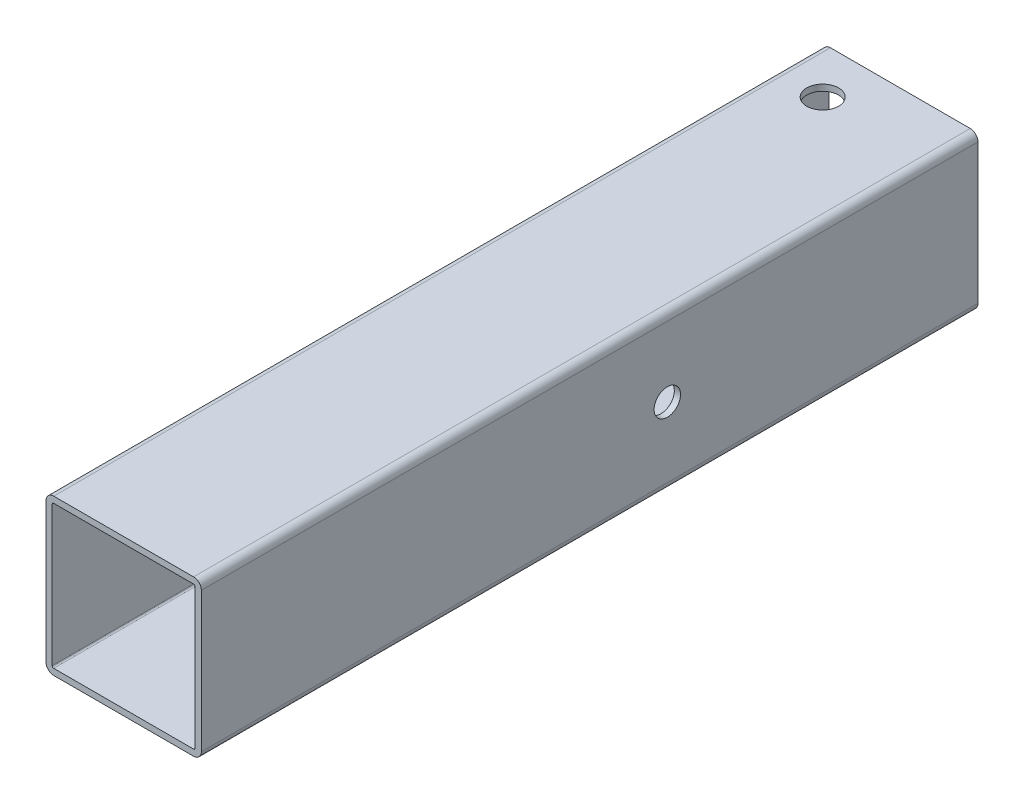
ISO-10303-21;
HEADER;
FILE_DESCRIPTION(('STEP AP214'),'2;1');
FILE_NAME('part.step','',(''),(''),'','','');
FILE_SCHEMA(('AUTOMOTIVE_DESIGN { 1 0 10303 214 1 1 1 1 }'));
ENDSEC;
DATA;
#1=APPLICATION_CONTEXT('core data for automotive mechanical design processes');
#2=APPLICATION_PROTOCOL_DEFINITION('international standard','automotive_design',2000,#1);
#3=PRODUCT_CONTEXT('',#1,'mechanical');
#4=PRODUCT('Part','Part','',(#3));
#5=PRODUCT_RELATED_PRODUCT_CATEGORY('part','',(#4));
#6=PRODUCT_DEFINITION_FORMATION('','',#4);
#7=PRODUCT_DEFINITION_CONTEXT('part definition',#1,'design');
#8=PRODUCT_DEFINITION('design','',#6,#7);
#9=PRODUCT_DEFINITION_SHAPE('','',#8);
#10=(LENGTH_UNIT() NAMED_UNIT(*) SI_UNIT(.MILLI.,.METRE.));
#11=(NAMED_UNIT(*) PLANE_ANGLE_UNIT() SI_UNIT($,.RADIAN.));
#12=(NAMED_UNIT(*) SI_UNIT($,.STERADIAN.) SOLID_ANGLE_UNIT());
#13=UNCERTAINTY_MEASURE_WITH_UNIT(LENGTH_MEASURE(1.E-05),#10,'distance_accuracy_value','');
#14=(GEOMETRIC_REPRESENTATION_CONTEXT(3) GLOBAL_UNCERTAINTY_ASSIGNED_CONTEXT((#13)) GLOBAL_UNIT_ASSIGNED_CONTEXT((#10,
#11,#12)) REPRESENTATION_CONTEXT('',''));
#15=CARTESIAN_POINT('',(0.,0.,0.));
#16=DIRECTION('',(0.,0.,1.));
#17=DIRECTION('',(1.,0.,0.));
#18=AXIS2_PLACEMENT_3D('',#15,#16,#17);
#19=CARTESIAN_POINT('',(95.,-5.,500.));
#20=DIRECTION('',(0.,0.,1.));
#21=DIRECTION('',(1.,0.,0.));
#22=AXIS2_PLACEMENT_3D('',#19,#20,#21);
#23=PLANE('',#22);
#24=CARTESIAN_POINT('',(95.,-5.,500.));
#25=DIRECTION('',(0.,0.,1.));
#26=DIRECTION('',(1.,0.,0.));
#27=AXIS2_PLACEMENT_3D('',#24,#25,#26);
#28=CIRCLE('',#27,5.);
#29=CARTESIAN_POINT('',(100.,-5.00000000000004,500.));
#30=VERTEX_POINT('',#29);
#31=CARTESIAN_POINT('',(95.,0.,500.));
#32=VERTEX_POINT('',#31);
#33=EDGE_CURVE('E231',#30,#32,#28,.T.);
#34=ORIENTED_EDGE('',*,*,#33,.T.);
#35=DIRECTION('',(-1.,0.,0.));
#36=VECTOR('',#35,1.);
#37=CARTESIAN_POINT('',(5.00000000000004,0.,500.));
#38=LINE('',#37,#36);
#39=CARTESIAN_POINT('',(5.00000000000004,0.,500.));
#40=VERTEX_POINT('',#39);
#41=EDGE_CURVE('E234',#32,#40,#38,.T.);
#42=ORIENTED_EDGE('',*,*,#41,.T.);
#43=CARTESIAN_POINT('',(5.,-5.,500.));
#44=DIRECTION('',(0.,0.,1.));
#45=DIRECTION('',(1.,0.,0.));
#46=AXIS2_PLACEMENT_3D('',#43,#44,#45);
#47=CIRCLE('',#46,5.);
#48=CARTESIAN_POINT('',(0.,-5.00000000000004,500.));
#49=VERTEX_POINT('',#48);
#50=EDGE_CURVE('E236',#40,#49,#47,.T.);
#51=ORIENTED_EDGE('',*,*,#50,.T.);
#52=DIRECTION('',(0.,-1.,0.));
#53=VECTOR('',#52,1.);
#54=CARTESIAN_POINT('',(0.,-5.00000000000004,500.));
#55=LINE('',#54,#53);
#56=CARTESIAN_POINT('',(0.,-95.,500.));
#57=VERTEX_POINT('',#56);
#58=EDGE_CURVE('E238',#49,#57,#55,.T.);
#59=ORIENTED_EDGE('',*,*,#58,.T.);
#60=CARTESIAN_POINT('',(5.00000000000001,-95.,500.));
#61=DIRECTION('',(0.,0.,1.));
#62=DIRECTION('',(-1.,0.,0.));
#63=AXIS2_PLACEMENT_3D('',#60,#61,#62);
#64=CIRCLE('',#63,5.);
#65=CARTESIAN_POINT('',(5.00000000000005,-100.,500.));
#66=VERTEX_POINT('',#65);
#67=EDGE_CURVE('E240',#57,#66,#64,.T.);
#68=ORIENTED_EDGE('',*,*,#67,.T.);
#69=DIRECTION('',(1.,0.,0.));
#70=VECTOR('',#69,1.);
#71=CARTESIAN_POINT('',(5.00000000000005,-100.,500.));
#72=LINE('',#71,#70);
#73=CARTESIAN_POINT('',(95.,-100.,500.));
#74=VERTEX_POINT('',#73);
#75=EDGE_CURVE('E242',#66,#74,#72,.T.);
#76=ORIENTED_EDGE('',*,*,#75,.T.);
#77=CARTESIAN_POINT('',(95.,-95.,500.));
#78=DIRECTION('',(0.,0.,1.));
#79=DIRECTION('',(1.,0.,0.));
#80=AXIS2_PLACEMENT_3D('',#77,#78,#79);
#81=CIRCLE('',#80,5.);
#82=CARTESIAN_POINT('',(100.,-95.,500.));
#83=VERTEX_POINT('',#82);
#84=EDGE_CURVE('E244',#74,#83,#81,.T.);
#85=ORIENTED_EDGE('',*,*,#84,.T.);
#86=DIRECTION('',(0.,1.,0.));
#87=VECTOR('',#86,1.);
#88=CARTESIAN_POINT('',(100.,-5.00000000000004,500.));
#89=LINE('',#88,#87);
#90=EDGE_CURVE('E246',#83,#30,#89,.T.);
#91=ORIENTED_EDGE('',*,*,#90,.T.);
#92=EDGE_LOOP('',(#34,#42,#51,#59,#68,#76,#85,#91));
#93=FACE_BOUND('',#92,.T.);
#94=DIRECTION('',(0.,-1.,0.));
#95=VECTOR('',#94,1.);
#96=CARTESIAN_POINT('',(4.,-5.00000000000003,500.));
#97=LINE('',#96,#95);
#98=CARTESIAN_POINT('',(4.,-5.00000000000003,500.));
#99=VERTEX_POINT('',#98);
#100=CARTESIAN_POINT('',(4.00000000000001,-95.,500.));
#101=VERTEX_POINT('',#100);
#102=EDGE_CURVE('E189',#99,#101,#97,.T.);
#103=ORIENTED_EDGE('',*,*,#102,.F.);
#104=CARTESIAN_POINT('',(5.,-5.,500.));
#105=DIRECTION('',(0.,0.,1.));
#106=DIRECTION('',(1.,0.,0.));
#107=AXIS2_PLACEMENT_3D('',#104,#105,#106);
#108=CIRCLE('',#107,0.999999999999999);
#109=CARTESIAN_POINT('',(5.00000000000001,-4.,500.));
#110=VERTEX_POINT('',#109);
#111=EDGE_CURVE('E161',#110,#99,#108,.T.);
#112=ORIENTED_EDGE('',*,*,#111,.F.);
#113=DIRECTION('',(-1.,0.,0.));
#114=VECTOR('',#113,1.);
#115=CARTESIAN_POINT('',(5.00000000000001,-4.,500.));
#116=LINE('',#115,#114);
#117=CARTESIAN_POINT('',(95.,-4.,500.));
#118=VERTEX_POINT('',#117);
#119=EDGE_CURVE('E201',#118,#110,#116,.T.);
#120=ORIENTED_EDGE('',*,*,#119,.F.);
#121=CARTESIAN_POINT('',(95.,-5.,500.));
#122=DIRECTION('',(0.,0.,1.));
#123=DIRECTION('',(1.,0.,0.));
#124=AXIS2_PLACEMENT_3D('',#121,#122,#123);
#125=CIRCLE('',#124,1.);
#126=CARTESIAN_POINT('',(96.,-5.00000000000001,500.));
#127=VERTEX_POINT('',#126);
#128=EDGE_CURVE('E199',#127,#118,#125,.T.);
#129=ORIENTED_EDGE('',*,*,#128,.F.);
#130=DIRECTION('',(0.,1.,0.));
#131=VECTOR('',#130,1.);
#132=CARTESIAN_POINT('',(96.,-5.00000000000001,500.));
#133=LINE('',#132,#131);
#134=CARTESIAN_POINT('',(96.,-95.,500.));
#135=VERTEX_POINT('',#134);
#136=EDGE_CURVE('E197',#135,#127,#133,.T.);
#137=ORIENTED_EDGE('',*,*,#136,.F.);
#138=CARTESIAN_POINT('',(95.,-95.,500.));
#139=DIRECTION('',(0.,0.,1.));
#140=DIRECTION('',(1.,0.,0.));
#141=AXIS2_PLACEMENT_3D('',#138,#139,#140);
#142=CIRCLE('',#141,1.);
#143=CARTESIAN_POINT('',(95.,-96.,500.));
#144=VERTEX_POINT('',#143);
#145=EDGE_CURVE('E195',#144,#135,#142,.T.);
#146=ORIENTED_EDGE('',*,*,#145,.F.);
#147=DIRECTION('',(1.,0.,0.));
#148=VECTOR('',#147,1.);
#149=CARTESIAN_POINT('',(5.00000000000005,-96.,500.));
#150=LINE('',#149,#148);
#151=CARTESIAN_POINT('',(5.00000000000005,-96.,500.));
#152=VERTEX_POINT('',#151);
#153=EDGE_CURVE('E193',#152,#144,#150,.T.);
#154=ORIENTED_EDGE('',*,*,#153,.F.);
#155=CARTESIAN_POINT('',(5.00000000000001,-95.,500.));
#156=DIRECTION('',(0.,0.,1.));
#157=DIRECTION('',(-1.,0.,0.));
#158=AXIS2_PLACEMENT_3D('',#155,#156,#157);
#159=CIRCLE('',#158,1.);
#160=EDGE_CURVE('E191',#101,#152,#159,.T.);
#161=ORIENTED_EDGE('',*,*,#160,.F.);
#162=EDGE_LOOP('',(#103,#112,#120,#129,#137,#146,#154,#161));
#163=FACE_BOUND('',#162,.T.);
#164=ADVANCED_FACE('F31',(#93,#163),#23,.T.);
#165=CARTESIAN_POINT('',(95.,-5.,0.));
#166=DIRECTION('',(0.,0.,1.));
#167=DIRECTION('',(1.,0.,0.));
#168=AXIS2_PLACEMENT_3D('',#165,#166,#167);
#169=PLANE('',#168);
#170=CARTESIAN_POINT('',(95.,-5.,0.));
#171=DIRECTION('',(0.,0.,1.));
#172=DIRECTION('',(1.,0.,0.));
#173=AXIS2_PLACEMENT_3D('',#170,#171,#172);
#174=CIRCLE('',#173,5.);
#175=CARTESIAN_POINT('',(100.,-5.00000000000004,0.));
#176=VERTEX_POINT('',#175);
#177=CARTESIAN_POINT('',(95.,0.,0.));
#178=VERTEX_POINT('',#177);
#179=EDGE_CURVE('E162',#176,#178,#174,.T.);
#180=ORIENTED_EDGE('',*,*,#179,.F.);
#181=DIRECTION('',(0.,1.,0.));
#182=VECTOR('',#181,1.);
#183=CARTESIAN_POINT('',(100.,-5.00000000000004,0.));
#184=LINE('',#183,#182);
#185=CARTESIAN_POINT('',(100.,-95.,0.));
#186=VERTEX_POINT('',#185);
#187=EDGE_CURVE('E229',#186,#176,#184,.T.);
#188=ORIENTED_EDGE('',*,*,#187,.F.);
#189=CARTESIAN_POINT('',(95.,-95.,0.));
#190=DIRECTION('',(0.,0.,1.));
#191=DIRECTION('',(1.,0.,0.));
#192=AXIS2_PLACEMENT_3D('',#189,#190,#191);
#193=CIRCLE('',#192,5.);
#194=CARTESIAN_POINT('',(95.,-100.,0.));
#195=VERTEX_POINT('',#194);
#196=EDGE_CURVE('E227',#195,#186,#193,.T.);
#197=ORIENTED_EDGE('',*,*,#196,.F.);
#198=DIRECTION('',(1.,0.,0.));
#199=VECTOR('',#198,1.);
#200=CARTESIAN_POINT('',(5.00000000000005,-100.,0.));
#201=LINE('',#200,#199);
#202=CARTESIAN_POINT('',(5.00000000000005,-100.,0.));
#203=VERTEX_POINT('',#202);
#204=EDGE_CURVE('E225',#203,#195,#201,.T.);
#205=ORIENTED_EDGE('',*,*,#204,.F.);
#206=CARTESIAN_POINT('',(5.00000000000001,-95.,0.));
#207=DIRECTION('',(0.,0.,1.));
#208=DIRECTION('',(-1.,0.,0.));
#209=AXIS2_PLACEMENT_3D('',#206,#207,#208);
#210=CIRCLE('',#209,5.);
#211=CARTESIAN_POINT('',(0.,-95.,0.));
#212=VERTEX_POINT('',#211);
#213=EDGE_CURVE('E223',#212,#203,#210,.T.);
#214=ORIENTED_EDGE('',*,*,#213,.F.);
#215=DIRECTION('',(0.,-1.,0.));
#216=VECTOR('',#215,1.);
#217=CARTESIAN_POINT('',(0.,-5.00000000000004,0.));
#218=LINE('',#217,#216);
#219=CARTESIAN_POINT('',(0.,-5.00000000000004,0.));
#220=VERTEX_POINT('',#219);
#221=EDGE_CURVE('E221',#220,#212,#218,.T.);
#222=ORIENTED_EDGE('',*,*,#221,.F.);
#223=CARTESIAN_POINT('',(5.,-5.,0.));
#224=DIRECTION('',(0.,0.,1.));
#225=DIRECTION('',(1.,0.,0.));
#226=AXIS2_PLACEMENT_3D('',#223,#224,#225);
#227=CIRCLE('',#226,5.);
#228=CARTESIAN_POINT('',(5.00000000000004,0.,0.));
#229=VERTEX_POINT('',#228);
#230=EDGE_CURVE('E219',#229,#220,#227,.T.);
#231=ORIENTED_EDGE('',*,*,#230,.F.);
#232=DIRECTION('',(-1.,0.,0.));
#233=VECTOR('',#232,1.);
#234=CARTESIAN_POINT('',(5.00000000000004,0.,0.));
#235=LINE('',#234,#233);
#236=EDGE_CURVE('E217',#178,#229,#235,.T.);
#237=ORIENTED_EDGE('',*,*,#236,.F.);
#238=EDGE_LOOP('',(#180,#188,#197,#205,#214,#222,#231,#237));
#239=FACE_BOUND('',#238,.T.);
#240=CARTESIAN_POINT('',(5.,-5.,0.));
#241=DIRECTION('',(0.,0.,1.));
#242=DIRECTION('',(1.,0.,0.));
#243=AXIS2_PLACEMENT_3D('',#240,#241,#242);
#244=CIRCLE('',#243,0.999999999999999);
#245=CARTESIAN_POINT('',(5.,-4.,0.));
#246=VERTEX_POINT('',#245);
#247=CARTESIAN_POINT('',(4.,-5.00000000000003,0.));
#248=VERTEX_POINT('',#247);
#249=EDGE_CURVE('E56',#246,#248,#244,.T.);
#250=ORIENTED_EDGE('',*,*,#249,.T.);
#251=DIRECTION('',(0.,-1.,0.));
#252=VECTOR('',#251,1.);
#253=CARTESIAN_POINT('',(4.,-5.00000000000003,0.));
#254=LINE('',#253,#252);
#255=CARTESIAN_POINT('',(4.00000000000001,-95.,0.));
#256=VERTEX_POINT('',#255);
#257=EDGE_CURVE('E148',#248,#256,#254,.T.);
#258=ORIENTED_EDGE('',*,*,#257,.T.);
#259=CARTESIAN_POINT('',(5.00000000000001,-95.,0.));
#260=DIRECTION('',(0.,0.,1.));
#261=DIRECTION('',(-1.,0.,0.));
#262=AXIS2_PLACEMENT_3D('',#259,#260,#261);
#263=CIRCLE('',#262,1.);
#264=CARTESIAN_POINT('',(5.00000000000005,-96.,0.));
#265=VERTEX_POINT('',#264);
#266=EDGE_CURVE('E157',#256,#265,#263,.T.);
#267=ORIENTED_EDGE('',*,*,#266,.T.);
#268=DIRECTION('',(1.,0.,0.));
#269=VECTOR('',#268,1.);
#270=CARTESIAN_POINT('',(5.00000000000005,-96.,0.));
#271=LINE('',#270,#269);
#272=CARTESIAN_POINT('',(95.,-96.,0.));
#273=VERTEX_POINT('',#272);
#274=EDGE_CURVE('E176',#265,#273,#271,.T.);
#275=ORIENTED_EDGE('',*,*,#274,.T.);
#276=CARTESIAN_POINT('',(95.,-95.,0.));
#277=DIRECTION('',(0.,0.,1.));
#278=DIRECTION('',(1.,0.,0.));
#279=AXIS2_PLACEMENT_3D('',#276,#277,#278);
#280=CIRCLE('',#279,1.);
#281=CARTESIAN_POINT('',(96.,-95.,0.));
#282=VERTEX_POINT('',#281);
#283=EDGE_CURVE('E179',#273,#282,#280,.T.);
#284=ORIENTED_EDGE('',*,*,#283,.T.);
#285=DIRECTION('',(0.,1.,0.));
#286=VECTOR('',#285,1.);
#287=CARTESIAN_POINT('',(96.,-5.00000000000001,0.));
#288=LINE('',#287,#286);
#289=CARTESIAN_POINT('',(96.,-5.00000000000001,0.));
#290=VERTEX_POINT('',#289);
#291=EDGE_CURVE('E182',#282,#290,#288,.T.);
#292=ORIENTED_EDGE('',*,*,#291,.T.);
#293=CARTESIAN_POINT('',(95.,-5.,0.));
#294=DIRECTION('',(0.,0.,1.));
#295=DIRECTION('',(1.,0.,0.));
#296=AXIS2_PLACEMENT_3D('',#293,#294,#295);
#297=CIRCLE('',#296,1.);
#298=CARTESIAN_POINT('',(95.,-4.,0.));
#299=VERTEX_POINT('',#298);
#300=EDGE_CURVE('E185',#290,#299,#297,.T.);
#301=ORIENTED_EDGE('',*,*,#300,.T.);
#302=DIRECTION('',(-1.,0.,0.));
#303=VECTOR('',#302,1.);
#304=CARTESIAN_POINT('',(5.00000000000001,-4.,0.));
#305=LINE('',#304,#303);
#306=EDGE_CURVE('E167',#299,#246,#305,.T.);
#307=ORIENTED_EDGE('',*,*,#306,.T.);
#308=EDGE_LOOP('',(#250,#258,#267,#275,#284,#292,#301,#307));
#309=FACE_BOUND('',#308,.T.);
#310=ADVANCED_FACE('F165',(#239,#309),#169,.F.);
#311=CARTESIAN_POINT('',(95.,-5.,500.));
#312=DIRECTION('',(0.,0.,-1.));
#313=DIRECTION('',(-1.,0.,0.));
#314=AXIS2_PLACEMENT_3D('',#311,#312,#313);
#315=CYLINDRICAL_SURFACE('',#314,5.);
#316=ORIENTED_EDGE('',*,*,#179,.T.);
#317=DIRECTION('',(0.,0.,-1.));
#318=VECTOR('',#317,1.);
#319=CARTESIAN_POINT('',(95.,0.,500.));
#320=LINE('',#319,#318);
#321=EDGE_CURVE('E11',#32,#178,#320,.T.);
#322=ORIENTED_EDGE('',*,*,#321,.F.);
#323=ORIENTED_EDGE('',*,*,#33,.F.);
#324=DIRECTION('',(0.,0.,-1.));
#325=VECTOR('',#324,1.);
#326=CARTESIAN_POINT('',(100.,-5.00000000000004,500.));
#327=LINE('',#326,#325);
#328=EDGE_CURVE('E248',#30,#176,#327,.T.);
#329=ORIENTED_EDGE('',*,*,#328,.T.);
#330=EDGE_LOOP('',(#316,#322,#323,#329));
#331=FACE_BOUND('',#330,.T.);
#332=ADVANCED_FACE('F33',(#331),#315,.T.);
#333=CARTESIAN_POINT('',(5.00000000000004,0.,500.));
#334=DIRECTION('',(0.,-1.,0.));
#335=DIRECTION('',(0.,0.,-1.));
#336=AXIS2_PLACEMENT_3D('',#333,#334,#335);
#337=PLANE('',#336);
#338=CARTESIAN_POINT('',(30.,0.,30.));
#339=DIRECTION('',(0.,1.,0.));
#340=DIRECTION('',(0.,0.,1.));
#341=AXIS2_PLACEMENT_3D('',#338,#339,#340);
#342=CIRCLE('',#341,10.25);
#343=CARTESIAN_POINT('',(30.,0.,40.25));
#344=VERTEX_POINT('',#343);
#345=EDGE_CURVE('E350',#344,#344,#342,.T.);
#346=ORIENTED_EDGE('',*,*,#345,.F.);
#347=EDGE_LOOP('',(#346));
#348=FACE_BOUND('',#347,.T.);
#349=ORIENTED_EDGE('',*,*,#236,.T.);
#350=DIRECTION('',(0.,0.,-1.));
#351=VECTOR('',#350,1.);
#352=CARTESIAN_POINT('',(5.00000000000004,0.,500.));
#353=LINE('',#352,#351);
#354=EDGE_CURVE('E40',#40,#229,#353,.T.);
#355=ORIENTED_EDGE('',*,*,#354,.F.);
#356=ORIENTED_EDGE('',*,*,#41,.F.);
#357=ORIENTED_EDGE('',*,*,#321,.T.);
#358=EDGE_LOOP('',(#349,#355,#356,#357));
#359=FACE_BOUND('',#358,.T.);
#360=ADVANCED_FACE('F339',(#348,#359),#337,.F.);
#361=CARTESIAN_POINT('',(5.,-5.,500.));
#362=DIRECTION('',(0.,0.,-1.));
#363=DIRECTION('',(-1.,0.,0.));
#364=AXIS2_PLACEMENT_3D('',#361,#362,#363);
#365=CYLINDRICAL_SURFACE('',#364,5.);
#366=ORIENTED_EDGE('',*,*,#230,.T.);
#367=DIRECTION('',(0.,0.,-1.));
#368=VECTOR('',#367,1.);
#369=CARTESIAN_POINT('',(0.,-5.00000000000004,500.));
#370=LINE('',#369,#368);
#371=EDGE_CURVE('E263',#49,#220,#370,.T.);
#372=ORIENTED_EDGE('',*,*,#371,.F.);
#373=ORIENTED_EDGE('',*,*,#50,.F.);
#374=ORIENTED_EDGE('',*,*,#354,.T.);
#375=EDGE_LOOP('',(#366,#372,#373,#374));
#376=FACE_BOUND('',#375,.T.);
#377=ADVANCED_FACE('F336',(#376),#365,.T.);
#378=CARTESIAN_POINT('',(0.,-5.00000000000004,500.));
#379=DIRECTION('',(1.,0.,0.));
#380=DIRECTION('',(0.,1.,0.));
#381=AXIS2_PLACEMENT_3D('',#378,#379,#380);
#382=PLANE('',#381);
#383=CARTESIAN_POINT('',(0.,-85.,30.));
#384=DIRECTION('',(-1.,0.,0.));
#385=DIRECTION('',(0.,-1.,0.));
#386=AXIS2_PLACEMENT_3D('',#383,#384,#385);
#387=CIRCLE('',#386,3.25);
#388=CARTESIAN_POINT('',(0.,-88.25,30.));
#389=VERTEX_POINT('',#388);
#390=EDGE_CURVE('E273',#389,#389,#387,.T.);
#391=ORIENTED_EDGE('',*,*,#390,.F.);
#392=EDGE_LOOP('',(#391));
#393=FACE_BOUND('',#392,.T.);
#394=CARTESIAN_POINT('',(0.,-50.,200.));
#395=DIRECTION('',(-1.,0.,0.));
#396=DIRECTION('',(0.,-1.,0.));
#397=AXIS2_PLACEMENT_3D('',#394,#395,#396);
#398=CIRCLE('',#397,8.49999999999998);
#399=CARTESIAN_POINT('',(0.,-58.5,200.));
#400=VERTEX_POINT('',#399);
#401=EDGE_CURVE('E272',#400,#400,#398,.T.);
#402=ORIENTED_EDGE('',*,*,#401,.F.);
#403=EDGE_LOOP('',(#402));
#404=FACE_BOUND('',#403,.T.);
#405=ORIENTED_EDGE('',*,*,#221,.T.);
#406=DIRECTION('',(0.,0.,-1.));
#407=VECTOR('',#406,1.);
#408=CARTESIAN_POINT('',(0.,-95.,500.));
#409=LINE('',#408,#407);
#410=EDGE_CURVE('E260',#57,#212,#409,.T.);
#411=ORIENTED_EDGE('',*,*,#410,.F.);
#412=ORIENTED_EDGE('',*,*,#58,.F.);
#413=ORIENTED_EDGE('',*,*,#371,.T.);
#414=EDGE_LOOP('',(#405,#411,#412,#413));
#415=FACE_BOUND('',#414,.T.);
#416=ADVANCED_FACE('F332',(#393,#404,#415),#382,.F.);
#417=CARTESIAN_POINT('',(5.00000000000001,-95.,500.));
#418=DIRECTION('',(0.,0.,-1.));
#419=DIRECTION('',(-1.,0.,0.));
#420=AXIS2_PLACEMENT_3D('',#417,#418,#419);
#421=CYLINDRICAL_SURFACE('',#420,5.);
#422=ORIENTED_EDGE('',*,*,#213,.T.);
#423=DIRECTION('',(0.,0.,-1.));
#424=VECTOR('',#423,1.);
#425=CARTESIAN_POINT('',(5.00000000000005,-100.,500.));
#426=LINE('',#425,#424);
#427=EDGE_CURVE('E257',#66,#203,#426,.T.);
#428=ORIENTED_EDGE('',*,*,#427,.F.);
#429=ORIENTED_EDGE('',*,*,#67,.F.);
#430=ORIENTED_EDGE('',*,*,#410,.T.);
#431=EDGE_LOOP('',(#422,#428,#429,#430));
#432=FACE_BOUND('',#431,.T.);
#433=ADVANCED_FACE('F328',(#432),#421,.T.);
#434=CARTESIAN_POINT('',(5.00000000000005,-100.,500.));
#435=DIRECTION('',(0.,1.,0.));
#436=DIRECTION('',(0.,0.,1.));
#437=AXIS2_PLACEMENT_3D('',#434,#435,#436);
#438=PLANE('',#437);
#439=CARTESIAN_POINT('',(30.,-100.,30.));
#440=DIRECTION('',(0.,1.,0.));
#441=DIRECTION('',(0.,0.,1.));
#442=AXIS2_PLACEMENT_3D('',#439,#440,#441);
#443=CIRCLE('',#442,10.25);
#444=CARTESIAN_POINT('',(30.,-100.,40.25));
#445=VERTEX_POINT('',#444);
#446=EDGE_CURVE('E376',#445,#445,#443,.T.);
#447=ORIENTED_EDGE('',*,*,#446,.T.);
#448=EDGE_LOOP('',(#447));
#449=FACE_BOUND('',#448,.T.);
#450=ORIENTED_EDGE('',*,*,#204,.T.);
#451=DIRECTION('',(0.,0.,-1.));
#452=VECTOR('',#451,1.);
#453=CARTESIAN_POINT('',(95.,-100.,500.));
#454=LINE('',#453,#452);
#455=EDGE_CURVE('E254',#74,#195,#454,.T.);
#456=ORIENTED_EDGE('',*,*,#455,.F.);
#457=ORIENTED_EDGE('',*,*,#75,.F.);
#458=ORIENTED_EDGE('',*,*,#427,.T.);
#459=EDGE_LOOP('',(#450,#456,#457,#458));
#460=FACE_BOUND('',#459,.T.);
#461=ADVANCED_FACE('F324',(#449,#460),#438,.F.);
#462=CARTESIAN_POINT('',(95.,-95.,500.));
#463=DIRECTION('',(0.,0.,-1.));
#464=DIRECTION('',(-1.,0.,0.));
#465=AXIS2_PLACEMENT_3D('',#462,#463,#464);
#466=CYLINDRICAL_SURFACE('',#465,5.);
#467=ORIENTED_EDGE('',*,*,#196,.T.);
#468=DIRECTION('',(0.,0.,-1.));
#469=VECTOR('',#468,1.);
#470=CARTESIAN_POINT('',(100.,-95.,500.));
#471=LINE('',#470,#469);
#472=EDGE_CURVE('E251',#83,#186,#471,.T.);
#473=ORIENTED_EDGE('',*,*,#472,.F.);
#474=ORIENTED_EDGE('',*,*,#84,.F.);
#475=ORIENTED_EDGE('',*,*,#455,.T.);
#476=EDGE_LOOP('',(#467,#473,#474,#475));
#477=FACE_BOUND('',#476,.T.);
#478=ADVANCED_FACE('F321',(#477),#466,.T.);
#479=CARTESIAN_POINT('',(100.,-5.00000000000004,500.));
#480=DIRECTION('',(-1.,0.,0.));
#481=DIRECTION('',(0.,0.,1.));
#482=AXIS2_PLACEMENT_3D('',#479,#480,#481);
#483=PLANE('',#482);
#484=CARTESIAN_POINT('',(100.,-50.,200.));
#485=DIRECTION('',(-1.,0.,0.));
#486=DIRECTION('',(0.,-1.,0.));
#487=AXIS2_PLACEMENT_3D('',#484,#485,#486);
#488=CIRCLE('',#487,8.49999999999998);
#489=CARTESIAN_POINT('',(100.,-58.5,200.));
#490=VERTEX_POINT('',#489);
#491=EDGE_CURVE('E269',#490,#490,#488,.T.);
#492=ORIENTED_EDGE('',*,*,#491,.T.);
#493=EDGE_LOOP('',(#492));
#494=FACE_BOUND('',#493,.T.);
#495=ORIENTED_EDGE('',*,*,#187,.T.);
#496=ORIENTED_EDGE('',*,*,#328,.F.);
#497=ORIENTED_EDGE('',*,*,#90,.F.);
#498=ORIENTED_EDGE('',*,*,#472,.T.);
#499=EDGE_LOOP('',(#495,#496,#497,#498));
#500=FACE_BOUND('',#499,.T.);
#501=ADVANCED_FACE('F289',(#494,#500),#483,.F.);
#502=CARTESIAN_POINT('',(5.,-5.,500.));
#503=DIRECTION('',(0.,0.,-1.));
#504=DIRECTION('',(-1.,0.,0.));
#505=AXIS2_PLACEMENT_3D('',#502,#503,#504);
#506=CYLINDRICAL_SURFACE('',#505,0.999999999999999);
#507=ORIENTED_EDGE('',*,*,#249,.F.);
#508=DIRECTION('',(0.,0.,-1.));
#509=VECTOR('',#508,1.);
#510=CARTESIAN_POINT('',(5.00000000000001,-4.,500.));
#511=LINE('',#510,#509);
#512=EDGE_CURVE('E203',#110,#246,#511,.T.);
#513=ORIENTED_EDGE('',*,*,#512,.F.);
#514=ORIENTED_EDGE('',*,*,#111,.T.);
#515=DIRECTION('',(0.,0.,-1.));
#516=VECTOR('',#515,1.);
#517=CARTESIAN_POINT('',(4.,-5.00000000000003,500.));
#518=LINE('',#517,#516);
#519=EDGE_CURVE('E150',#99,#248,#518,.T.);
#520=ORIENTED_EDGE('',*,*,#519,.T.);
#521=EDGE_LOOP('',(#507,#513,#514,#520));
#522=FACE_BOUND('',#521,.T.);
#523=ADVANCED_FACE('F159',(#522),#506,.F.);
#524=CARTESIAN_POINT('',(4.,-5.00000000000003,500.));
#525=DIRECTION('',(1.,0.,0.));
#526=DIRECTION('',(0.,1.,0.));
#527=AXIS2_PLACEMENT_3D('',#524,#525,#526);
#528=PLANE('',#527);
#529=CARTESIAN_POINT('',(4.00000000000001,-85.,30.));
#530=DIRECTION('',(1.,0.,0.));
#531=DIRECTION('',(0.,1.,0.));
#532=AXIS2_PLACEMENT_3D('',#529,#530,#531);
#533=CIRCLE('',#532,3.25);
#534=CARTESIAN_POINT('',(4.00000000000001,-81.75,30.));
#535=VERTEX_POINT('',#534);
#536=EDGE_CURVE('E270',#535,#535,#533,.T.);
#537=ORIENTED_EDGE('',*,*,#536,.F.);
#538=EDGE_LOOP('',(#537));
#539=FACE_BOUND('',#538,.T.);
#540=CARTESIAN_POINT('',(4.,-50.,200.));
#541=DIRECTION('',(1.,0.,0.));
#542=DIRECTION('',(0.,1.,0.));
#543=AXIS2_PLACEMENT_3D('',#540,#541,#542);
#544=CIRCLE('',#543,8.49999999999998);
#545=CARTESIAN_POINT('',(4.,-41.5,200.));
#546=VERTEX_POINT('',#545);
#547=EDGE_CURVE('E168',#546,#546,#544,.T.);
#548=ORIENTED_EDGE('',*,*,#547,.F.);
#549=EDGE_LOOP('',(#548));
#550=FACE_BOUND('',#549,.T.);
#551=ORIENTED_EDGE('',*,*,#257,.F.);
#552=ORIENTED_EDGE('',*,*,#519,.F.);
#553=ORIENTED_EDGE('',*,*,#102,.T.);
#554=DIRECTION('',(0.,0.,-1.));
#555=VECTOR('',#554,1.);
#556=CARTESIAN_POINT('',(4.00000000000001,-95.,500.));
#557=LINE('',#556,#555);
#558=EDGE_CURVE('E153',#101,#256,#557,.T.);
#559=ORIENTED_EDGE('',*,*,#558,.T.);
#560=EDGE_LOOP('',(#551,#552,#553,#559));
#561=FACE_BOUND('',#560,.T.);
#562=ADVANCED_FACE('F149',(#539,#550,#561),#528,.T.);
#563=CARTESIAN_POINT('',(5.00000000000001,-95.,500.));
#564=DIRECTION('',(0.,0.,-1.));
#565=DIRECTION('',(-1.,0.,0.));
#566=AXIS2_PLACEMENT_3D('',#563,#564,#565);
#567=CYLINDRICAL_SURFACE('',#566,1.);
#568=ORIENTED_EDGE('',*,*,#266,.F.);
#569=ORIENTED_EDGE('',*,*,#558,.F.);
#570=ORIENTED_EDGE('',*,*,#160,.T.);
#571=DIRECTION('',(0.,0.,-1.));
#572=VECTOR('',#571,1.);
#573=CARTESIAN_POINT('',(5.00000000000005,-96.,500.));
#574=LINE('',#573,#572);
#575=EDGE_CURVE('E212',#152,#265,#574,.T.);
#576=ORIENTED_EDGE('',*,*,#575,.T.);
#577=EDGE_LOOP('',(#568,#569,#570,#576));
#578=FACE_BOUND('',#577,.T.);
#579=ADVANCED_FACE('F394',(#578),#567,.F.);
#580=CARTESIAN_POINT('',(5.00000000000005,-96.,500.));
#581=DIRECTION('',(0.,1.,0.));
#582=DIRECTION('',(0.,0.,1.));
#583=AXIS2_PLACEMENT_3D('',#580,#581,#582);
#584=PLANE('',#583);
#585=CARTESIAN_POINT('',(30.,-96.,30.));
#586=DIRECTION('',(0.,1.,0.));
#587=DIRECTION('',(0.,0.,1.));
#588=AXIS2_PLACEMENT_3D('',#585,#586,#587);
#589=CIRCLE('',#588,10.25);
#590=CARTESIAN_POINT('',(30.,-96.,40.25));
#591=VERTEX_POINT('',#590);
#592=EDGE_CURVE('E279',#591,#591,#589,.T.);
#593=ORIENTED_EDGE('',*,*,#592,.F.);
#594=EDGE_LOOP('',(#593));
#595=FACE_BOUND('',#594,.T.);
#596=ORIENTED_EDGE('',*,*,#274,.F.);
#597=ORIENTED_EDGE('',*,*,#575,.F.);
#598=ORIENTED_EDGE('',*,*,#153,.T.);
#599=DIRECTION('',(0.,0.,-1.));
#600=VECTOR('',#599,1.);
#601=CARTESIAN_POINT('',(95.,-96.,500.));
#602=LINE('',#601,#600);
#603=EDGE_CURVE('E210',#144,#273,#602,.T.);
#604=ORIENTED_EDGE('',*,*,#603,.T.);
#605=EDGE_LOOP('',(#596,#597,#598,#604));
#606=FACE_BOUND('',#605,.T.);
#607=ADVANCED_FACE('F399',(#595,#606),#584,.T.);
#608=CARTESIAN_POINT('',(95.,-95.,500.));
#609=DIRECTION('',(0.,0.,-1.));
#610=DIRECTION('',(-1.,0.,0.));
#611=AXIS2_PLACEMENT_3D('',#608,#609,#610);
#612=CYLINDRICAL_SURFACE('',#611,1.);
#613=ORIENTED_EDGE('',*,*,#283,.F.);
#614=ORIENTED_EDGE('',*,*,#603,.F.);
#615=ORIENTED_EDGE('',*,*,#145,.T.);
#616=DIRECTION('',(0.,0.,-1.));
#617=VECTOR('',#616,1.);
#618=CARTESIAN_POINT('',(96.,-95.,500.));
#619=LINE('',#618,#617);
#620=EDGE_CURVE('E208',#135,#282,#619,.T.);
#621=ORIENTED_EDGE('',*,*,#620,.T.);
#622=EDGE_LOOP('',(#613,#614,#615,#621));
#623=FACE_BOUND('',#622,.T.);
#624=ADVANCED_FACE('F403',(#623),#612,.F.);
#625=CARTESIAN_POINT('',(96.,-5.00000000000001,500.));
#626=DIRECTION('',(-1.,0.,0.));
#627=DIRECTION('',(0.,0.,1.));
#628=AXIS2_PLACEMENT_3D('',#625,#626,#627);
#629=PLANE('',#628);
#630=CARTESIAN_POINT('',(96.,-50.,200.));
#631=DIRECTION('',(-1.,0.,0.));
#632=DIRECTION('',(0.,0.,1.));
#633=AXIS2_PLACEMENT_3D('',#630,#631,#632);
#634=CIRCLE('',#633,8.49999999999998);
#635=CARTESIAN_POINT('',(96.,-50.,208.5));
#636=VERTEX_POINT('',#635);
#637=EDGE_CURVE('E171',#636,#636,#634,.T.);
#638=ORIENTED_EDGE('',*,*,#637,.F.);
#639=EDGE_LOOP('',(#638));
#640=FACE_BOUND('',#639,.T.);
#641=ORIENTED_EDGE('',*,*,#291,.F.);
#642=ORIENTED_EDGE('',*,*,#620,.F.);
#643=ORIENTED_EDGE('',*,*,#136,.T.);
#644=DIRECTION('',(0.,0.,-1.));
#645=VECTOR('',#644,1.);
#646=CARTESIAN_POINT('',(96.,-5.00000000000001,500.));
#647=LINE('',#646,#645);
#648=EDGE_CURVE('E206',#127,#290,#647,.T.);
#649=ORIENTED_EDGE('',*,*,#648,.T.);
#650=EDGE_LOOP('',(#641,#642,#643,#649));
#651=FACE_BOUND('',#650,.T.);
#652=ADVANCED_FACE('F406',(#640,#651),#629,.T.);
#653=CARTESIAN_POINT('',(95.,-5.,500.));
#654=DIRECTION('',(0.,0.,-1.));
#655=DIRECTION('',(-1.,0.,0.));
#656=AXIS2_PLACEMENT_3D('',#653,#654,#655);
#657=CYLINDRICAL_SURFACE('',#656,1.);
#658=ORIENTED_EDGE('',*,*,#300,.F.);
#659=ORIENTED_EDGE('',*,*,#648,.F.);
#660=ORIENTED_EDGE('',*,*,#128,.T.);
#661=DIRECTION('',(0.,0.,-1.));
#662=VECTOR('',#661,1.);
#663=CARTESIAN_POINT('',(95.,-4.,500.));
#664=LINE('',#663,#662);
#665=EDGE_CURVE('E48',#118,#299,#664,.T.);
#666=ORIENTED_EDGE('',*,*,#665,.T.);
#667=EDGE_LOOP('',(#658,#659,#660,#666));
#668=FACE_BOUND('',#667,.T.);
#669=ADVANCED_FACE('F304',(#668),#657,.F.);
#670=CARTESIAN_POINT('',(5.00000000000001,-4.,500.));
#671=DIRECTION('',(0.,-1.,0.));
#672=DIRECTION('',(0.,0.,-1.));
#673=AXIS2_PLACEMENT_3D('',#670,#671,#672);
#674=PLANE('',#673);
#675=CARTESIAN_POINT('',(30.,-4.,30.));
#676=DIRECTION('',(0.,-1.,0.));
#677=DIRECTION('',(0.,0.,-1.));
#678=AXIS2_PLACEMENT_3D('',#675,#676,#677);
#679=CIRCLE('',#678,10.25);
#680=CARTESIAN_POINT('',(30.,-4.,19.75));
#681=VERTEX_POINT('',#680);
#682=EDGE_CURVE('E35',#681,#681,#679,.T.);
#683=ORIENTED_EDGE('',*,*,#682,.F.);
#684=EDGE_LOOP('',(#683));
#685=FACE_BOUND('',#684,.T.);
#686=ORIENTED_EDGE('',*,*,#306,.F.);
#687=ORIENTED_EDGE('',*,*,#665,.F.);
#688=ORIENTED_EDGE('',*,*,#119,.T.);
#689=ORIENTED_EDGE('',*,*,#512,.T.);
#690=EDGE_LOOP('',(#686,#687,#688,#689));
#691=FACE_BOUND('',#690,.T.);
#692=ADVANCED_FACE('F295',(#685,#691),#674,.T.);
#693=CARTESIAN_POINT('',(100.,-50.,200.));
#694=DIRECTION('',(-1.,0.,0.));
#695=DIRECTION('',(0.,-1.,0.));
#696=AXIS2_PLACEMENT_3D('',#693,#694,#695);
#697=CYLINDRICAL_SURFACE('',#696,8.49999999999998);
#698=ORIENTED_EDGE('',*,*,#637,.T.);
#699=EDGE_LOOP('',(#698));
#700=FACE_BOUND('',#699,.T.);
#701=ORIENTED_EDGE('',*,*,#491,.F.);
#702=EDGE_LOOP('',(#701));
#703=FACE_BOUND('',#702,.T.);
#704=ADVANCED_FACE('F292',(#700,#703),#697,.F.);
#705=ORIENTED_EDGE('',*,*,#547,.T.);
#706=EDGE_LOOP('',(#705));
#707=FACE_BOUND('',#706,.T.);
#708=ORIENTED_EDGE('',*,*,#401,.T.);
#709=EDGE_LOOP('',(#708));
#710=FACE_BOUND('',#709,.T.);
#711=ADVANCED_FACE('F294',(#707,#710),#697,.F.);
#712=CARTESIAN_POINT('',(10.,-85.,30.));
#713=DIRECTION('',(-1.,0.,0.));
#714=DIRECTION('',(0.,-1.,0.));
#715=AXIS2_PLACEMENT_3D('',#712,#713,#714);
#716=CYLINDRICAL_SURFACE('',#715,3.25);
#717=ORIENTED_EDGE('',*,*,#536,.T.);
#718=EDGE_LOOP('',(#717));
#719=FACE_BOUND('',#718,.T.);
#720=ORIENTED_EDGE('',*,*,#390,.T.);
#721=EDGE_LOOP('',(#720));
#722=FACE_BOUND('',#721,.T.);
#723=ADVANCED_FACE('F302',(#719,#722),#716,.F.);
#724=CARTESIAN_POINT('',(30.,-100.,30.));
#725=DIRECTION('',(0.,1.,0.));
#726=DIRECTION('',(0.,0.,1.));
#727=AXIS2_PLACEMENT_3D('',#724,#725,#726);
#728=CYLINDRICAL_SURFACE('',#727,10.25);
#729=ORIENTED_EDGE('',*,*,#682,.T.);
#730=EDGE_LOOP('',(#729));
#731=FACE_BOUND('',#730,.T.);
#732=ORIENTED_EDGE('',*,*,#345,.T.);
#733=EDGE_LOOP('',(#732));
#734=FACE_BOUND('',#733,.T.);
#735=ADVANCED_FACE('F383',(#731,#734),#728,.F.);
#736=ORIENTED_EDGE('',*,*,#592,.T.);
#737=EDGE_LOOP('',(#736));
#738=FACE_BOUND('',#737,.T.);
#739=ORIENTED_EDGE('',*,*,#446,.F.);
#740=EDGE_LOOP('',(#739));
#741=FACE_BOUND('',#740,.T.);
#742=ADVANCED_FACE('F520',(#738,#741),#728,.F.);
#743=CLOSED_SHELL('',(#164,#310,#332,#360,#377,#416,#433,#461,#478,#501,#523,#562,#579,#607,
#624,#652,#669,#692,#704,#711,#723,#735,#742));
#744=MANIFOLD_SOLID_BREP('B2',#743);
#745=ADVANCED_BREP_SHAPE_REPRESENTATION('',(#18,#744),#14);
#746=SHAPE_DEFINITION_REPRESENTATION(#9,#745);
ENDSEC;
END-ISO-10303-21;
